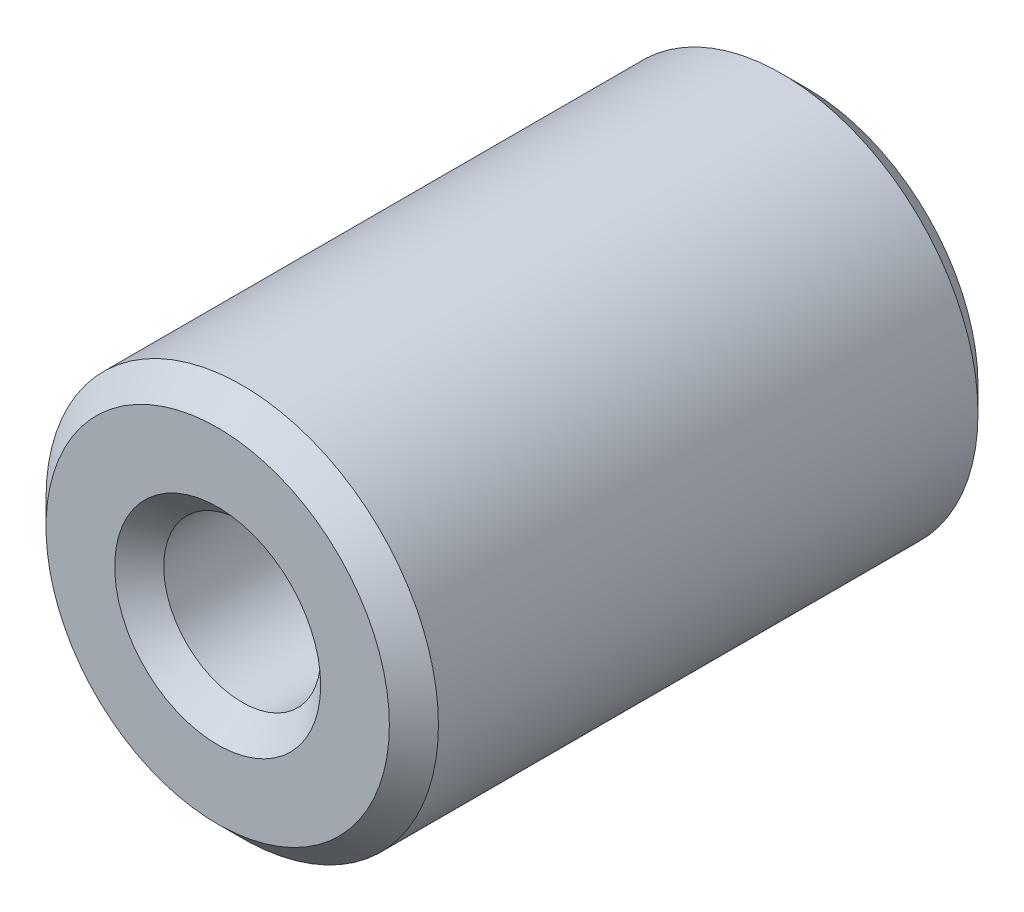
from build123d import *

# Parameters (mm, degrees)
SKETCH_1_R      = 2
SKETCH_1_R_2    = 0.8
EXTRUDE_1_DEPTH = 6
CHAMFER_1_SIZE  = 0.25


with BuildPart() as part:
    # Sketch 1 → Extrude 1 (new body)
    with BuildSketch(Plane.XY):
        Circle(SKETCH_1_R)
        Circle(SKETCH_1_R_2, mode=Mode.SUBTRACT)
    extrude(amount=EXTRUDE_1_DEPTH)

    # Chamfer 1
    chamfer_1_edges = [part.edges().sort_by_distance(p)[0] for p in [
        (-2, 0, 0),
        (-2, 0, 6),
        (-0.8, 0, 0),
        (-0.8, 0, 6),
    ]]
    chamfer(chamfer_1_edges, length=CHAMFER_1_SIZE)


solid = part.part
